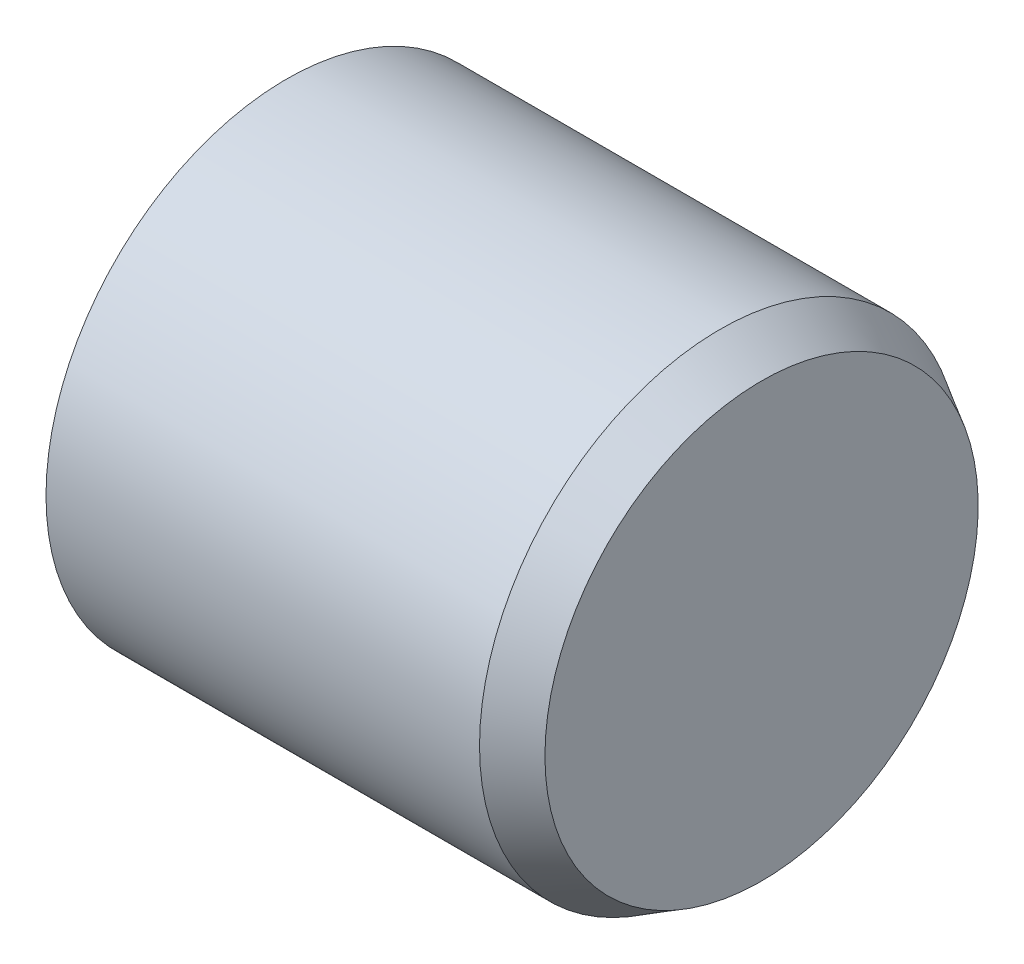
ISO-10303-21;
HEADER;
FILE_DESCRIPTION(('STEP AP214'),'2;1');
FILE_NAME('part.step','',(''),(''),'','','');
FILE_SCHEMA(('AUTOMOTIVE_DESIGN { 1 0 10303 214 1 1 1 1 }'));
ENDSEC;
DATA;
#1=APPLICATION_CONTEXT('core data for automotive mechanical design processes');
#2=APPLICATION_PROTOCOL_DEFINITION('international standard','automotive_design',2000,#1);
#3=PRODUCT_CONTEXT('',#1,'mechanical');
#4=PRODUCT('Part','Part','',(#3));
#5=PRODUCT_RELATED_PRODUCT_CATEGORY('part','',(#4));
#6=PRODUCT_DEFINITION_FORMATION('','',#4);
#7=PRODUCT_DEFINITION_CONTEXT('part definition',#1,'design');
#8=PRODUCT_DEFINITION('design','',#6,#7);
#9=PRODUCT_DEFINITION_SHAPE('','',#8);
#10=(LENGTH_UNIT() NAMED_UNIT(*) SI_UNIT(.MILLI.,.METRE.));
#11=(NAMED_UNIT(*) PLANE_ANGLE_UNIT() SI_UNIT($,.RADIAN.));
#12=(NAMED_UNIT(*) SI_UNIT($,.STERADIAN.) SOLID_ANGLE_UNIT());
#13=UNCERTAINTY_MEASURE_WITH_UNIT(LENGTH_MEASURE(1.E-05),#10,'distance_accuracy_value','');
#14=(GEOMETRIC_REPRESENTATION_CONTEXT(3) GLOBAL_UNCERTAINTY_ASSIGNED_CONTEXT((#13)) GLOBAL_UNIT_ASSIGNED_CONTEXT((#10,
#11,#12)) REPRESENTATION_CONTEXT('',''));
#15=CARTESIAN_POINT('',(0.,0.,0.));
#16=DIRECTION('',(0.,0.,1.));
#17=DIRECTION('',(1.,0.,0.));
#18=AXIS2_PLACEMENT_3D('',#15,#16,#17);
#19=CARTESIAN_POINT('',(0.,0.,0.));
#20=DIRECTION('',(1.,0.,0.));
#21=DIRECTION('',(0.,0.,-1.));
#22=AXIS2_PLACEMENT_3D('',#19,#20,#21);
#23=PLANE('',#22);
#24=CARTESIAN_POINT('',(0.,0.,0.));
#25=DIRECTION('',(-1.,0.,0.));
#26=DIRECTION('',(0.,0.,1.));
#27=AXIS2_PLACEMENT_3D('',#24,#25,#26);
#28=CIRCLE('',#27,3.9878);
#29=CARTESIAN_POINT('',(0.,0.,3.9878));
#30=VERTEX_POINT('',#29);
#31=EDGE_CURVE('E10',#30,#30,#28,.T.);
#32=ORIENTED_EDGE('',*,*,#31,.T.);
#33=EDGE_LOOP('',(#32));
#34=FACE_BOUND('',#33,.T.);
#35=ADVANCED_FACE('F33',(#34),#23,.F.);
#36=CARTESIAN_POINT('',(-11.702387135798,0.,0.));
#37=DIRECTION('',(-1.,0.,0.));
#38=DIRECTION('',(0.,0.,1.));
#39=AXIS2_PLACEMENT_3D('',#36,#37,#38);
#40=CYLINDRICAL_SURFACE('',#39,3.9878);
#41=ORIENTED_EDGE('',*,*,#31,.F.);
#42=EDGE_LOOP('',(#41));
#43=FACE_BOUND('',#42,.T.);
#44=CARTESIAN_POINT('',(7.1865923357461,0.,0.));
#45=DIRECTION('',(-1.,0.,0.));
#46=DIRECTION('',(0.,0.,1.));
#47=AXIS2_PLACEMENT_3D('',#44,#45,#46);
#48=CIRCLE('',#47,3.9878);
#49=CARTESIAN_POINT('',(7.1865923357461,0.,3.9878));
#50=VERTEX_POINT('',#49);
#51=EDGE_CURVE('E39',#50,#50,#48,.T.);
#52=ORIENTED_EDGE('',*,*,#51,.T.);
#53=EDGE_LOOP('',(#52));
#54=FACE_BOUND('',#53,.T.);
#55=ADVANCED_FACE('F58',(#43,#54),#40,.T.);
#56=CARTESIAN_POINT('',(7.874,0.,0.));
#57=DIRECTION('',(-1.,0.,0.));
#58=DIRECTION('',(0.,0.,1.));
#59=AXIS2_PLACEMENT_3D('',#56,#57,#58);
#60=CONICAL_SURFACE('',#59,3.590925,0.5235987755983);
#61=ORIENTED_EDGE('',*,*,#51,.F.);
#62=EDGE_LOOP('',(#61));
#63=FACE_BOUND('',#62,.T.);
#64=CARTESIAN_POINT('',(7.874,0.,0.));
#65=DIRECTION('',(-1.,0.,0.));
#66=DIRECTION('',(0.,0.,1.));
#67=AXIS2_PLACEMENT_3D('',#64,#65,#66);
#68=CIRCLE('',#67,3.590925);
#69=CARTESIAN_POINT('',(7.874,0.,3.590925));
#70=VERTEX_POINT('',#69);
#71=EDGE_CURVE('E43',#70,#70,#68,.T.);
#72=ORIENTED_EDGE('',*,*,#71,.T.);
#73=EDGE_LOOP('',(#72));
#74=FACE_BOUND('',#73,.T.);
#75=ADVANCED_FACE('F50',(#63,#74),#60,.T.);
#76=CARTESIAN_POINT('',(7.874,3.590925,0.));
#77=DIRECTION('',(-1.,0.,0.));
#78=DIRECTION('',(0.,0.,1.));
#79=AXIS2_PLACEMENT_3D('',#76,#77,#78);
#80=PLANE('',#79);
#81=ORIENTED_EDGE('',*,*,#71,.F.);
#82=EDGE_LOOP('',(#81));
#83=FACE_BOUND('',#82,.T.);
#84=ADVANCED_FACE('F52',(#83),#80,.F.);
#85=CLOSED_SHELL('',(#35,#55,#75,#84));
#86=MANIFOLD_SOLID_BREP('B2',#85);
#87=ADVANCED_BREP_SHAPE_REPRESENTATION('',(#18,#86),#14);
#88=SHAPE_DEFINITION_REPRESENTATION(#9,#87);
ENDSEC;
END-ISO-10303-21;
